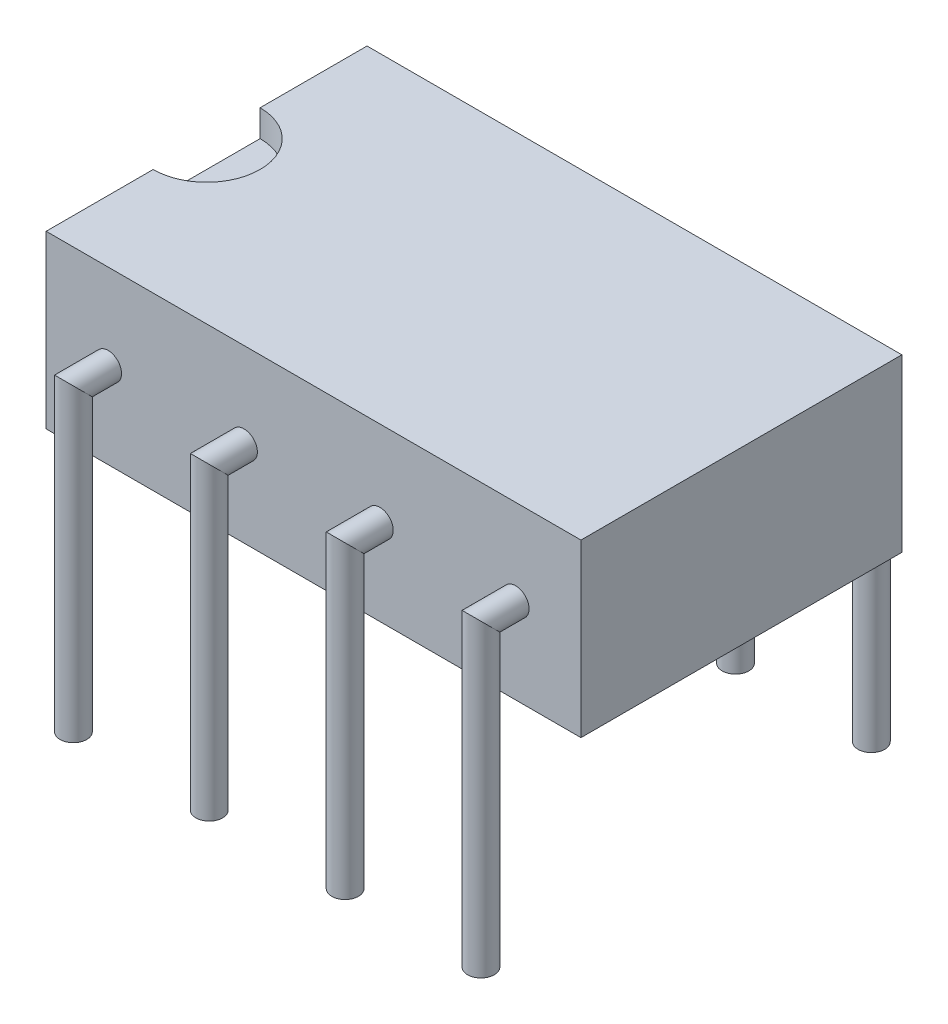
from build123d import *

# Parameters (mm, degrees)
ESQUISSE1_W                          = 6
ESQUISSE1_H                          = 3.2
EXTRUSION1_DEPTH                     = 10
ENL_V_MAT_EXTRU_1_DEPTH              = 0.5
ESQUISSE3_R                          = 0.25
R_P_TITION_LIN_AIRE1_COUNT           = 4
R_P_TITION_LIN_AIRE1_PITCH           = 2.54
R_P_TITION_LIN_AIRE1_COPY_1_SKETCH_R = 0.25
R_P_TITION_LIN_AIRE1_COPY_2_SKETCH_R = 0.25
R_P_TITION_LIN_AIRE1_COPY_3_SKETCH_R = 0.25


with BuildPart() as part:
    # Esquisse1 → Extrusion1 (new body)
    with BuildSketch(Plane(origin=(0, 0, 0), x_dir=(0, 0, -1), z_dir=(1, 0, 0))):
        with Locations((0, 1.6)):
            Rectangle(ESQUISSE1_W, ESQUISSE1_H)
    extrude(amount=EXTRUSION1_DEPTH)

    # Esquisse2 → Enl_v. mat.-Extru.1 (cut)
    with BuildSketch(Plane(origin=(0, 3.2, 0), x_dir=(-1, 0, 0), z_dir=(0, 1, 0))):
        with BuildLine():
            Line((0, -1), (0, 1))
            ThreePointArc((0, 1), (-1, 0), (0, -1))
        make_face()
    extrude(amount=-ENL_V_MAT_EXTRU_1_DEPTH, mode=Mode.SUBTRACT)

    # Balayage1: sweep along a path in Esquisse5
    with BuildLine(Plane(origin=(1.16, 0, 0), x_dir=(0, 0, -1), z_dir=(1, 0, 0))) as balayage1_path:
        Line((-3, 1.6), (-3.65, 1.6))
        Line((-3.65, 1.6), (-3.65, -4))
    # Esquisse3 → Balayage1 (sweep)
    with BuildSketch(Plane.XY.offset(3)):
        with Locations((1.16, 1.6)):
            Circle(ESQUISSE3_R)
    balayage1 = sweep(path=balayage1_path.line, transition=Transition.RIGHT)

    # Sym_trie1: Balayage1 across plane
    add(balayage1.mirror(Plane.XY))

    # R_p_tition lin_aire1: Balayage1 ×4
    with Locations(*[(i * R_P_TITION_LIN_AIRE1_PITCH, 0, 0) for i in range(1, R_P_TITION_LIN_AIRE1_COUNT)]):
        add(balayage1)

    # R_p_tition lin_aire1 copy 1: sweep along a path in R_p_tition lin_aire1 copy 1 path
    with BuildLine(Plane(origin=(3.7, 0, 0), x_dir=(0, 0, 1), z_dir=(1, 0, 0))) as r_p_tition_lin_aire1_copy_1_path:
        Line((-3, -1.6), (-3.65, -1.6))
        Line((-3.65, -1.6), (-3.65, 4))
    # R_p_tition lin_aire1 copy 1 sketch → R_p_tition lin_aire1 copy 1 (sweep)
    with BuildSketch(Plane(origin=(2.54, 0, -3), x_dir=(1, 0, 0), z_dir=(0, 0, -1))):
        with Locations((1.16, -1.6)):
            Circle(R_P_TITION_LIN_AIRE1_COPY_1_SKETCH_R)
    sweep(path=r_p_tition_lin_aire1_copy_1_path.line, transition=Transition.RIGHT)

    # R_p_tition lin_aire1 copy 2: sweep along a path in R_p_tition lin_aire1 copy 2 path
    with BuildLine(Plane(origin=(6.24, 0, 0), x_dir=(0, 0, 1), z_dir=(1, 0, 0))) as r_p_tition_lin_aire1_copy_2_path:
        Line((-3, -1.6), (-3.65, -1.6))
        Line((-3.65, -1.6), (-3.65, 4))
    # R_p_tition lin_aire1 copy 2 sketch → R_p_tition lin_aire1 copy 2 (sweep)
    with BuildSketch(Plane(origin=(5.08, 0, -3), x_dir=(1, 0, 0), z_dir=(0, 0, -1))):
        with Locations((1.16, -1.6)):
            Circle(R_P_TITION_LIN_AIRE1_COPY_2_SKETCH_R)
    sweep(path=r_p_tition_lin_aire1_copy_2_path.line, transition=Transition.RIGHT)

    # R_p_tition lin_aire1 copy 3: sweep along a path in R_p_tition lin_aire1 copy 3 path
    with BuildLine(Plane(origin=(8.78, 0, 0), x_dir=(0, 0, 1), z_dir=(1, 0, 0))) as r_p_tition_lin_aire1_copy_3_path:
        Line((-3, -1.6), (-3.65, -1.6))
        Line((-3.65, -1.6), (-3.65, 4))
    # R_p_tition lin_aire1 copy 3 sketch → R_p_tition lin_aire1 copy 3 (sweep)
    with BuildSketch(Plane(origin=(7.62, 0, -3), x_dir=(1, 0, 0), z_dir=(0, 0, -1))):
        with Locations((1.16, -1.6)):
            Circle(R_P_TITION_LIN_AIRE1_COPY_3_SKETCH_R)
    sweep(path=r_p_tition_lin_aire1_copy_3_path.line, transition=Transition.RIGHT)


solid = part.part
